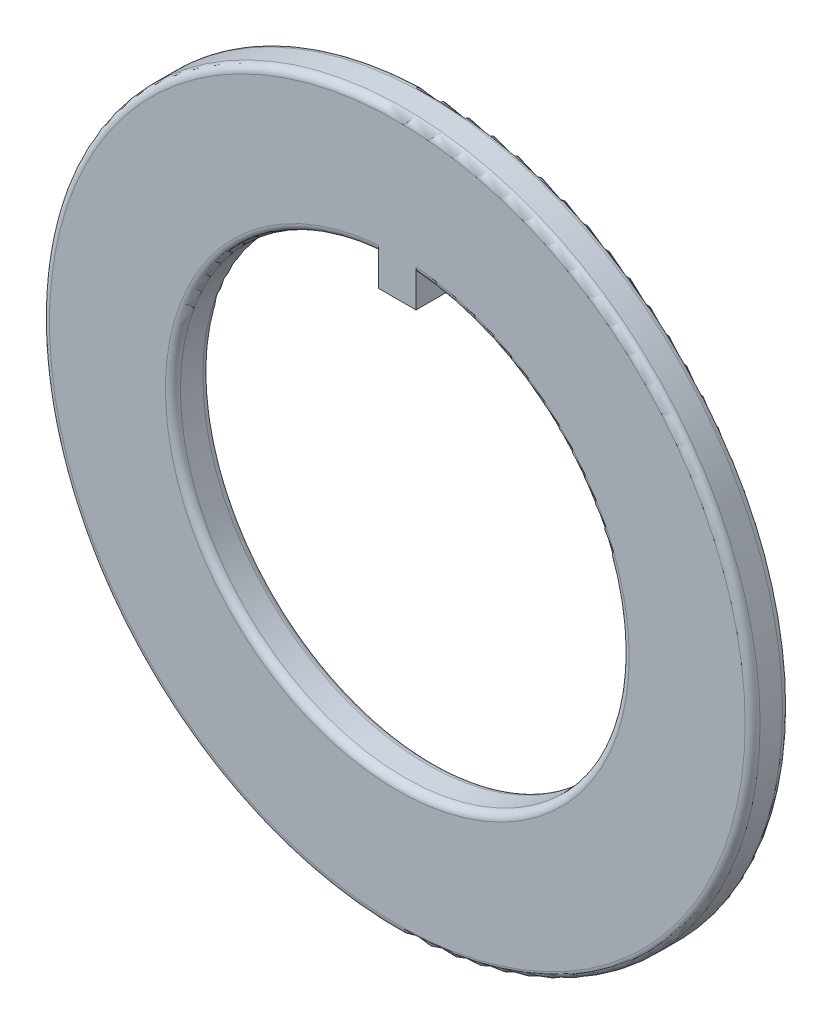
from build123d import *

# Parameters (mm, degrees)
ESQUISSE1_R        = 9.5
BOSS_EXTRU_1_DEPTH = 1
CONG_1_R           = 0.2


with BuildPart() as part:
    # Esquisse1 → Boss.-Extru.1 (new body)
    with BuildSketch(Plane.XY):
        Circle(ESQUISSE1_R)
        with BuildLine():
            Line((-0.5, 5.979130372), (-0.5, 5.179130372))
            Line((-0.5, 5.179130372), (0.5, 5.179130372))
            Line((0.5, 5.179130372), (0.5, 5.979130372))
            ThreePointArc((0.5, 5.979130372), (0, -6), (-0.5, 5.979130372))
        make_face(mode=Mode.SUBTRACT)
    extrude(amount=BOSS_EXTRU_1_DEPTH)

    # Cong_1
    cong_1_edges = [part.edges().sort_by_distance(p)[0] for p in [
        (-9.5, 0, 0),
        (-9.5, 0, 1),
        (0, -6, 0),
        (0, -6, 1),
    ]]
    fillet(cong_1_edges, radius=CONG_1_R)


solid = part.part
